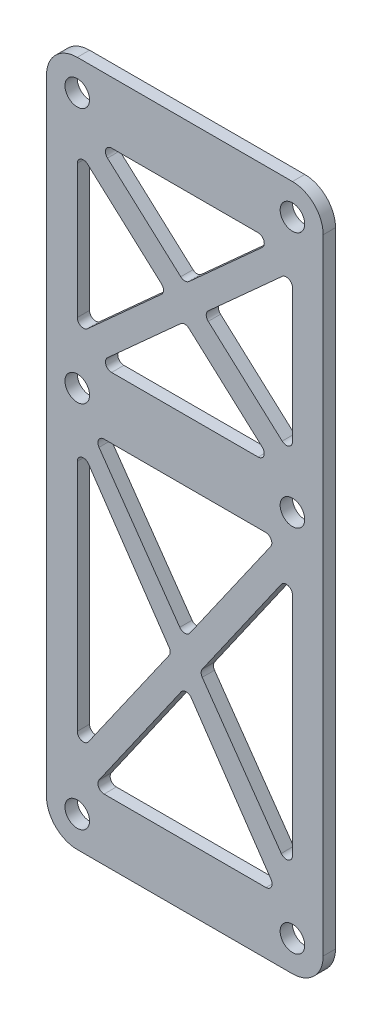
from build123d import *

# Parameters (mm, degrees)
SKETCH_1_R      = 2
EXTRUDE_1_DEPTH = 2


with BuildPart() as part:
    # Sketch 1 → Extrude 1 (new body)
    with BuildSketch(Plane.XY):
        with BuildLine():
            Line((-89.756242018, 41.14697152), (-54.756242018, 41.14697152))
            ThreePointArc((-54.756242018, 41.14697152), (-51.220708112, 39.682505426), (-49.756242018, 36.14697152))
            Line((-49.756242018, 36.14697152), (-49.756242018, -65.45302848))
            ThreePointArc((-49.756242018, -65.45302848), (-51.220708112, -68.988562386), (-54.756242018, -70.45302848))
            Line((-54.756242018, -70.45302848), (-89.756242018, -70.45302848))
            ThreePointArc((-89.756242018, -70.45302848), (-93.291775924, -68.988562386), (-94.756242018, -65.45302848))
            Line((-94.756242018, -65.45302848), (-94.756242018, 36.14697152))
            ThreePointArc((-94.756242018, 36.14697152), (-93.291775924, 39.682505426), (-89.756242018, 41.14697152))
        make_face()
        with Locations((-54.756242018, -65.45302848)):
            Circle(SKETCH_1_R, mode=Mode.SUBTRACT)
        with Locations((-54.756242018, -5.45302848)):
            Circle(SKETCH_1_R, mode=Mode.SUBTRACT)
        with Locations((-54.756242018, 36.14697152)):
            Circle(SKETCH_1_R, mode=Mode.SUBTRACT)
        with Locations((-89.756242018, 36.14697152)):
            Circle(SKETCH_1_R, mode=Mode.SUBTRACT)
        with Locations((-89.756242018, -5.45302848)):
            Circle(SKETCH_1_R, mode=Mode.SUBTRACT)
        with Locations((-89.756242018, -65.45302848)):
            Circle(SKETCH_1_R, mode=Mode.SUBTRACT)
        with BuildLine():
            Line((-85.399136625, -10.45302848), (-59.114847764, -10.45302848))
            ThreePointArc((-59.114847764, -10.45302848), (-58.227858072, -10.991239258), (-58.295643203, -12.026529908))
            Line((-58.295643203, -12.026529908), (-71.442806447, -30.80628456))
            ThreePointArc((-71.442806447, -30.80628456), (-72.262190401, -31.232783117), (-73.08142128, -30.805990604))
            Line((-73.08142128, -30.805990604), (-86.218546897, -12.026235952))
            ThreePointArc((-86.218546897, -12.026235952), (-86.286043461, -10.991080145), (-85.399136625, -10.45302848))
        make_face(mode=Mode.SUBTRACT)
        with BuildLine():
            Line((-54.756242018, -17.077983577), (-54.756242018, -53.828073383))
            ThreePointArc((-54.756242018, -53.828073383), (-55.45575098, -54.781858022), (-56.57565229, -54.401280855))
            Line((-56.57565229, -54.401280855), (-69.429668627, -36.026235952))
            ThreePointArc((-69.429668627, -36.026235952), (-69.610258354, -35.45302848), (-69.429668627, -34.879821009))
            Line((-69.429668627, -34.879821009), (-56.57565229, -16.504776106))
            ThreePointArc((-56.57565229, -16.504776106), (-55.45575098, -16.124198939), (-54.756242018, -17.077983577))
        make_face(mode=Mode.SUBTRACT)
        with BuildLine():
            Line((-59.063540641, -60.45302848), (-85.399136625, -60.45302848))
            ThreePointArc((-85.399136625, -60.45302848), (-86.286043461, -59.914976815), (-86.218546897, -58.879821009))
            Line((-86.218546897, -58.879821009), (-72.86213231, -39.786588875))
            ThreePointArc((-72.86213231, -39.786588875), (-72.036027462, -39.359818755), (-71.215710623, -39.797611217))
            Line((-71.215710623, -39.797611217), (-58.236529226, -58.890843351))
            ThreePointArc((-58.236529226, -58.890843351), (-58.179746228, -59.920903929), (-59.063540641, -60.45302848))
        make_face(mode=Mode.SUBTRACT)
        with BuildLine():
            Line((-89.756242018, -53.79357764), (-89.756242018, -15.773105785))
            ThreePointArc((-89.756242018, -15.773105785), (-89.050341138, -14.81733086), (-87.929230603, -15.210920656))
            Line((-87.929230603, -15.210920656), (-74.816427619, -34.50071896))
            ThreePointArc((-74.816427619, -34.50071896), (-74.64346266, -35.069778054), (-74.824234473, -35.636405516))
            Line((-74.824234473, -35.636405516), (-87.937037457, -54.367079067))
            ThreePointArc((-87.937037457, -54.367079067), (-89.056904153, -54.747308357), (-89.756242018, -53.79357764))
        make_face(mode=Mode.SUBTRACT)
        with BuildLine():
            Line((-84.171940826, 31.14697152), (-60.340543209, 31.14697152))
            ThreePointArc((-60.340543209, 31.14697152), (-59.407205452, 30.505971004), (-59.670407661, 29.40473278))
            Line((-59.670407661, 29.40473278), (-71.58610647, 18.646558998))
            ThreePointArc((-71.58610647, 18.646558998), (-72.256242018, 18.388797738), (-72.926377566, 18.646558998))
            Line((-72.926377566, 18.646558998), (-84.842076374, 29.40473278))
            ThreePointArc((-84.842076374, 29.40473278), (-85.105278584, 30.505971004), (-84.171940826, 31.14697152))
        make_face(mode=Mode.SUBTRACT)
        with BuildLine():
            Line((-54.756242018, 26.202288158), (-54.756242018, 4.491654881))
            ThreePointArc((-54.756242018, 4.491654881), (-55.35012353, 3.577834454), (-56.426377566, 3.749416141))
            Line((-56.426377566, 3.749416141), (-68.449671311, 14.60473278))
            ThreePointArc((-68.449671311, 14.60473278), (-68.779535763, 15.34697152), (-68.449671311, 16.08921026))
            Line((-68.449671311, 16.08921026), (-56.426377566, 26.944526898))
            ThreePointArc((-56.426377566, 26.944526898), (-55.35012353, 27.116108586), (-54.756242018, 26.202288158))
        make_face(mode=Mode.SUBTRACT)
        with BuildLine():
            Line((-60.340543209, -0.45302848), (-84.171940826, -0.45302848))
            ThreePointArc((-84.171940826, -0.45302848), (-85.105278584, 0.187972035), (-84.842076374, 1.28921026))
            Line((-84.842076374, 1.28921026), (-72.926377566, 12.047384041))
            ThreePointArc((-72.926377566, 12.047384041), (-72.256242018, 12.305145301), (-71.58610647, 12.047384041))
            Line((-71.58610647, 12.047384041), (-59.670407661, 1.28921026))
            ThreePointArc((-59.670407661, 1.28921026), (-59.407205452, 0.187972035), (-60.340543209, -0.45302848))
        make_face(mode=Mode.SUBTRACT)
        with BuildLine():
            Line((-89.756242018, 26.202288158), (-89.756242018, 4.491654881))
            ThreePointArc((-89.756242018, 4.491654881), (-89.162360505, 3.577834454), (-88.08610647, 3.749416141))
            Line((-88.08610647, 3.749416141), (-76.062812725, 14.60473278))
            ThreePointArc((-76.062812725, 14.60473278), (-75.732948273, 15.34697152), (-76.062812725, 16.08921026))
            Line((-76.062812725, 16.08921026), (-88.08610647, 26.944526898))
            ThreePointArc((-88.08610647, 26.944526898), (-89.162360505, 27.116108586), (-89.756242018, 26.202288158))
        make_face(mode=Mode.SUBTRACT)
    extrude(amount=EXTRUDE_1_DEPTH)


solid = part.part
